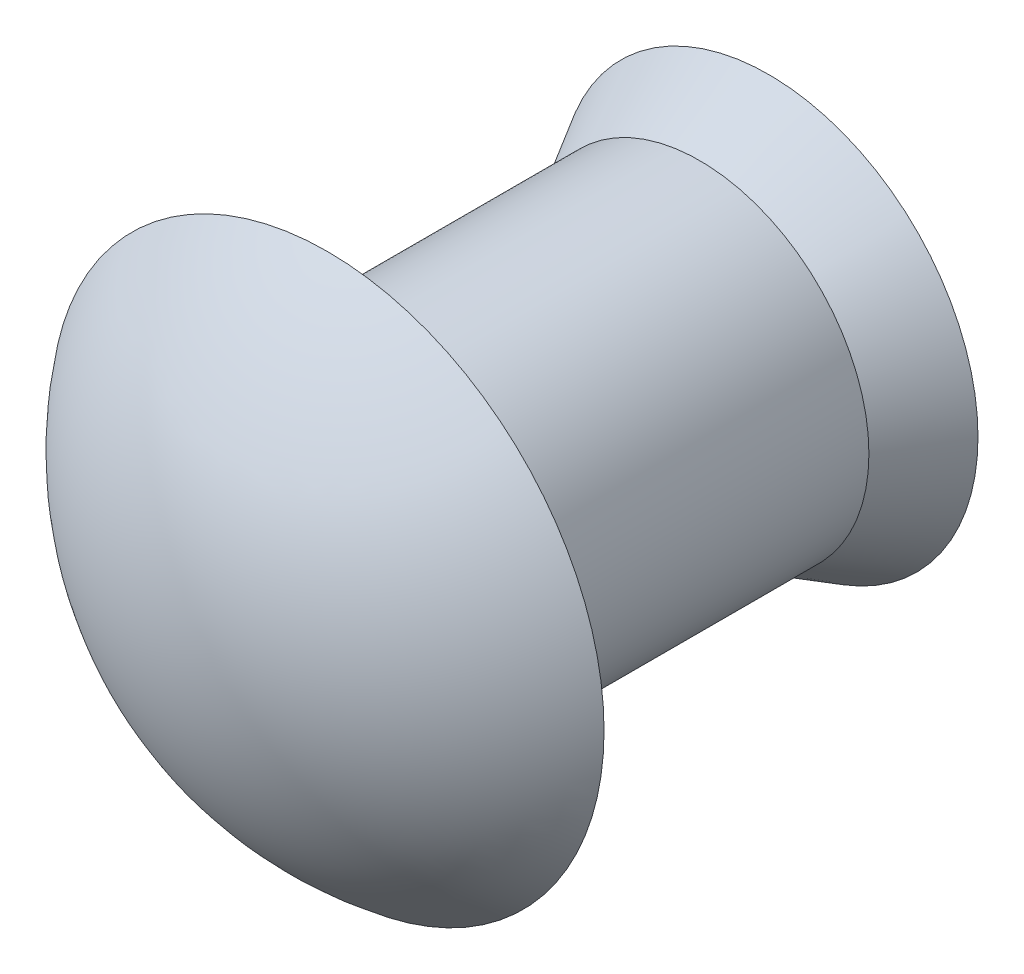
from build123d import *


with BuildPart() as part:
    # Sketch 1 → Revolve 1 (revolve)
    with BuildSketch(Plane(origin=(0, 0, 0), x_dir=(0, 0, -1), z_dir=(1, 0, 0)), mode=Mode.PRIVATE) as revolve_1_sk:
        with BuildLine():
            Line((1.5875, 3.175), (1.5875, 1.9431))
            Line((1.5875, 1.9431), (5.85978, 1.9431))
            Line((5.85978, 1.9431), (6.65353, 2.401371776))
            Line((6.65353, 2.401371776), (6.65353, 0))
            Line((6.65353, 0), (0, 0))
            ThreePointArc((0, 0), (0.418992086, 1.774878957), (1.5875, 3.175))
        make_face()
    revolve(revolve_1_sk.sketch.rotate(Axis((0, 0, 0), (0, 0, -1)), 90), axis=Axis((0, 0, 0), (0, 0, -1)))


solid = part.part
